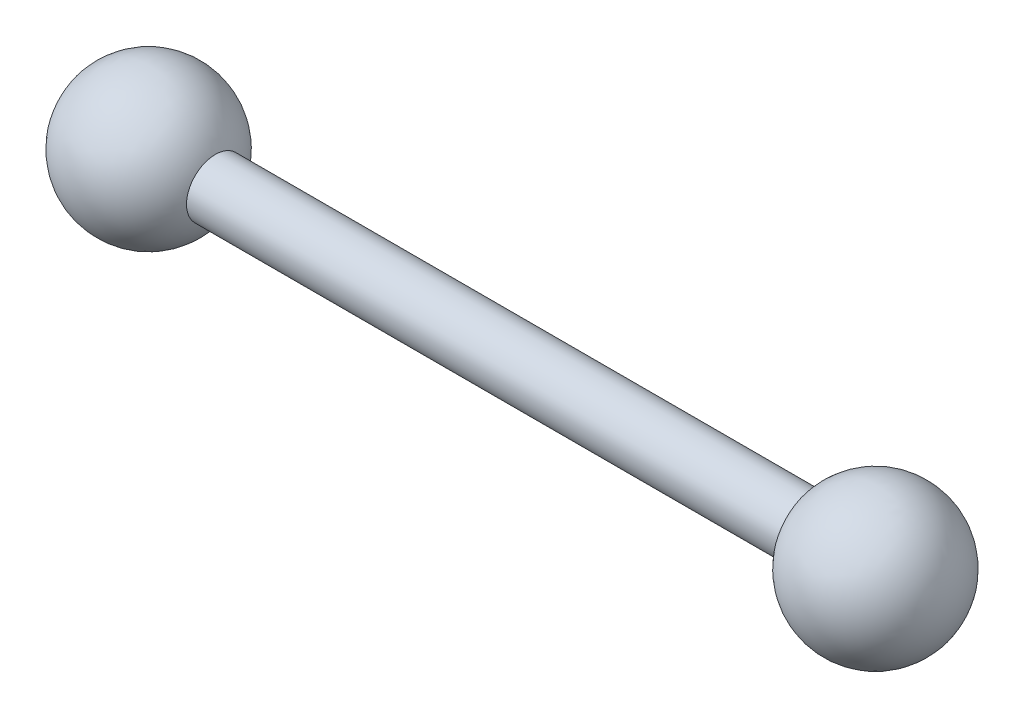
from build123d import *


with BuildPart() as part:
    # Esquisse1 → Base-R_volution (revolve)
    with BuildSketch(Plane.XY):
        with BuildLine():
            Line((4.590446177, 1.98186879), (45.409553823, 1.98186879))
            ThreePointArc((45.409553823, 1.98186879), (51.011871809, 4.896541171), (55, 0))
            Line((55, 0), (-5, 0))
            ThreePointArc((-5, 0), (-1.011871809, 4.896541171), (4.590446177, 1.98186879))
        make_face()
    revolve(axis=Axis((-16.729608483, 0, 0), (1, 0, 0)))


solid = part.part
